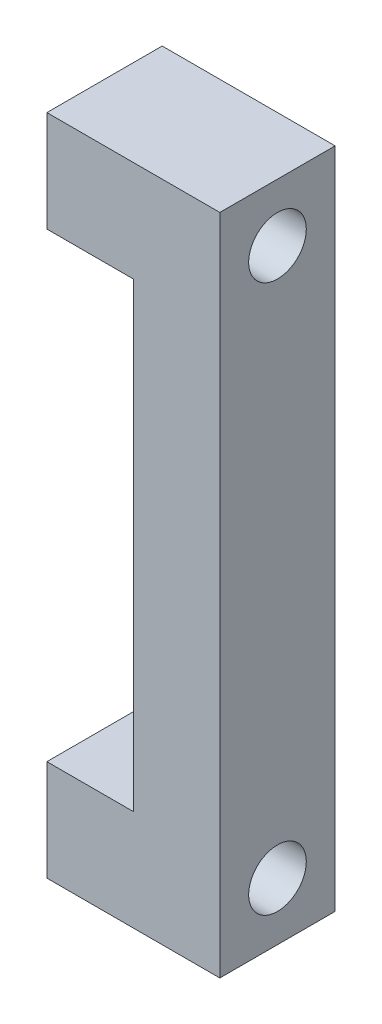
ISO-10303-21;
HEADER;
FILE_DESCRIPTION(('STEP AP214'),'2;1');
FILE_NAME('part.step','',(''),(''),'','','');
FILE_SCHEMA(('AUTOMOTIVE_DESIGN { 1 0 10303 214 1 1 1 1 }'));
ENDSEC;
DATA;
#1=APPLICATION_CONTEXT('core data for automotive mechanical design processes');
#2=APPLICATION_PROTOCOL_DEFINITION('international standard','automotive_design',2000,#1);
#3=PRODUCT_CONTEXT('',#1,'mechanical');
#4=PRODUCT('Part','Part','',(#3));
#5=PRODUCT_RELATED_PRODUCT_CATEGORY('part','',(#4));
#6=PRODUCT_DEFINITION_FORMATION('','',#4);
#7=PRODUCT_DEFINITION_CONTEXT('part definition',#1,'design');
#8=PRODUCT_DEFINITION('design','',#6,#7);
#9=PRODUCT_DEFINITION_SHAPE('','',#8);
#10=(LENGTH_UNIT() NAMED_UNIT(*) SI_UNIT(.MILLI.,.METRE.));
#11=(NAMED_UNIT(*) PLANE_ANGLE_UNIT() SI_UNIT($,.RADIAN.));
#12=(NAMED_UNIT(*) SI_UNIT($,.STERADIAN.) SOLID_ANGLE_UNIT());
#13=UNCERTAINTY_MEASURE_WITH_UNIT(LENGTH_MEASURE(1.E-05),#10,'distance_accuracy_value','');
#14=(GEOMETRIC_REPRESENTATION_CONTEXT(3) GLOBAL_UNCERTAINTY_ASSIGNED_CONTEXT((#13)) GLOBAL_UNIT_ASSIGNED_CONTEXT((#10,
#11,#12)) REPRESENTATION_CONTEXT('',''));
#15=CARTESIAN_POINT('',(0.,0.,0.));
#16=DIRECTION('',(0.,0.,1.));
#17=DIRECTION('',(1.,0.,0.));
#18=AXIS2_PLACEMENT_3D('',#15,#16,#17);
#19=CARTESIAN_POINT('',(-19.05,-25.4,6.35));
#20=DIRECTION('',(1.,0.,0.));
#21=DIRECTION('',(0.,0.,-1.));
#22=AXIS2_PLACEMENT_3D('',#19,#20,#21);
#23=PLANE('',#22);
#24=CARTESIAN_POINT('',(-19.05,-30.1625,0.));
#25=DIRECTION('',(1.,0.,0.));
#26=DIRECTION('',(0.,0.,-1.));
#27=AXIS2_PLACEMENT_3D('',#24,#25,#26);
#28=CIRCLE('',#27,3.175);
#29=CARTESIAN_POINT('',(-19.05,-30.1625,-3.175));
#30=VERTEX_POINT('',#29);
#31=EDGE_CURVE('E183',#30,#30,#28,.T.);
#32=ORIENTED_EDGE('',*,*,#31,.T.);
#33=EDGE_LOOP('',(#32));
#34=FACE_BOUND('',#33,.T.);
#35=DIRECTION('',(0.,-1.,0.));
#36=VECTOR('',#35,1.);
#37=CARTESIAN_POINT('',(-19.05,-25.4,-6.35));
#38=LINE('',#37,#36);
#39=CARTESIAN_POINT('',(-19.05,-25.4,-6.35));
#40=VERTEX_POINT('',#39);
#41=CARTESIAN_POINT('',(-19.05,-36.5125,-6.35));
#42=VERTEX_POINT('',#41);
#43=EDGE_CURVE('E130',#40,#42,#38,.T.);
#44=ORIENTED_EDGE('',*,*,#43,.T.);
#45=DIRECTION('',(0.,0.,-1.));
#46=VECTOR('',#45,1.);
#47=CARTESIAN_POINT('',(-19.05,-36.5125,6.35));
#48=LINE('',#47,#46);
#49=CARTESIAN_POINT('',(-19.05,-36.5125,6.35));
#50=VERTEX_POINT('',#49);
#51=EDGE_CURVE('E11',#50,#42,#48,.T.);
#52=ORIENTED_EDGE('',*,*,#51,.F.);
#53=DIRECTION('',(0.,-1.,0.));
#54=VECTOR('',#53,1.);
#55=CARTESIAN_POINT('',(-19.05,-25.4,6.35));
#56=LINE('',#55,#54);
#57=CARTESIAN_POINT('',(-19.05,-25.4,6.35));
#58=VERTEX_POINT('',#57);
#59=EDGE_CURVE('E145',#58,#50,#56,.T.);
#60=ORIENTED_EDGE('',*,*,#59,.F.);
#61=DIRECTION('',(0.,0.,-1.));
#62=VECTOR('',#61,1.);
#63=CARTESIAN_POINT('',(-19.05,-25.4,6.35));
#64=LINE('',#63,#62);
#65=EDGE_CURVE('E126',#58,#40,#64,.T.);
#66=ORIENTED_EDGE('',*,*,#65,.T.);
#67=EDGE_LOOP('',(#44,#52,#60,#66));
#68=FACE_BOUND('',#67,.T.);
#69=ADVANCED_FACE('F33',(#34,#68),#23,.F.);
#70=CARTESIAN_POINT('',(-19.05,-36.5125,6.35));
#71=DIRECTION('',(0.,1.,0.));
#72=DIRECTION('',(0.,0.,1.));
#73=AXIS2_PLACEMENT_3D('',#70,#71,#72);
#74=PLANE('',#73);
#75=DIRECTION('',(1.,0.,0.));
#76=VECTOR('',#75,1.);
#77=CARTESIAN_POINT('',(-19.05,-36.5125,-6.35));
#78=LINE('',#77,#76);
#79=CARTESIAN_POINT('',(0.,-36.5125,-6.35));
#80=VERTEX_POINT('',#79);
#81=EDGE_CURVE('E133',#42,#80,#78,.T.);
#82=ORIENTED_EDGE('',*,*,#81,.T.);
#83=DIRECTION('',(0.,0.,-1.));
#84=VECTOR('',#83,1.);
#85=CARTESIAN_POINT('',(0.,-36.5125,6.35));
#86=LINE('',#85,#84);
#87=CARTESIAN_POINT('',(0.,-36.5125,6.35));
#88=VERTEX_POINT('',#87);
#89=EDGE_CURVE('E42',#88,#80,#86,.T.);
#90=ORIENTED_EDGE('',*,*,#89,.F.);
#91=DIRECTION('',(1.,0.,0.));
#92=VECTOR('',#91,1.);
#93=CARTESIAN_POINT('',(-19.05,-36.5125,6.35));
#94=LINE('',#93,#92);
#95=EDGE_CURVE('E93',#50,#88,#94,.T.);
#96=ORIENTED_EDGE('',*,*,#95,.F.);
#97=ORIENTED_EDGE('',*,*,#51,.T.);
#98=EDGE_LOOP('',(#82,#90,#96,#97));
#99=FACE_BOUND('',#98,.T.);
#100=ADVANCED_FACE('F161',(#99),#74,.F.);
#101=CARTESIAN_POINT('',(0.,0.,6.35));
#102=DIRECTION('',(-1.,0.,0.));
#103=DIRECTION('',(0.,0.,1.));
#104=AXIS2_PLACEMENT_3D('',#101,#102,#103);
#105=PLANE('',#104);
#106=CARTESIAN_POINT('',(0.,-30.1625,0.));
#107=DIRECTION('',(1.,0.,0.));
#108=DIRECTION('',(0.,0.,-1.));
#109=AXIS2_PLACEMENT_3D('',#106,#107,#108);
#110=CIRCLE('',#109,3.175);
#111=CARTESIAN_POINT('',(0.,-30.1625,-3.175));
#112=VERTEX_POINT('',#111);
#113=EDGE_CURVE('E186',#112,#112,#110,.T.);
#114=ORIENTED_EDGE('',*,*,#113,.F.);
#115=EDGE_LOOP('',(#114));
#116=FACE_BOUND('',#115,.T.);
#117=CARTESIAN_POINT('',(0.,30.1625,0.));
#118=DIRECTION('',(1.,0.,0.));
#119=DIRECTION('',(0.,0.,-1.));
#120=AXIS2_PLACEMENT_3D('',#117,#118,#119);
#121=CIRCLE('',#120,3.175);
#122=CARTESIAN_POINT('',(0.,30.1625,-3.175));
#123=VERTEX_POINT('',#122);
#124=EDGE_CURVE('E180',#123,#123,#121,.T.);
#125=ORIENTED_EDGE('',*,*,#124,.F.);
#126=EDGE_LOOP('',(#125));
#127=FACE_BOUND('',#126,.T.);
#128=DIRECTION('',(0.,1.,0.));
#129=VECTOR('',#128,1.);
#130=CARTESIAN_POINT('',(0.,0.,-6.35));
#131=LINE('',#130,#129);
#132=CARTESIAN_POINT('',(0.,36.5125,-6.35));
#133=VERTEX_POINT('',#132);
#134=EDGE_CURVE('E136',#80,#133,#131,.T.);
#135=ORIENTED_EDGE('',*,*,#134,.T.);
#136=DIRECTION('',(0.,0.,-1.));
#137=VECTOR('',#136,1.);
#138=CARTESIAN_POINT('',(0.,36.5125,6.35));
#139=LINE('',#138,#137);
#140=CARTESIAN_POINT('',(0.,36.5125,6.35));
#141=VERTEX_POINT('',#140);
#142=EDGE_CURVE('E152',#141,#133,#139,.T.);
#143=ORIENTED_EDGE('',*,*,#142,.F.);
#144=DIRECTION('',(0.,1.,0.));
#145=VECTOR('',#144,1.);
#146=CARTESIAN_POINT('',(0.,-36.5125,6.35));
#147=LINE('',#146,#145);
#148=EDGE_CURVE('E160',#88,#141,#147,.T.);
#149=ORIENTED_EDGE('',*,*,#148,.F.);
#150=ORIENTED_EDGE('',*,*,#89,.T.);
#151=EDGE_LOOP('',(#135,#143,#149,#150));
#152=FACE_BOUND('',#151,.T.);
#153=ADVANCED_FACE('F158',(#116,#127,#152),#105,.F.);
#154=CARTESIAN_POINT('',(0.,36.5125,6.35));
#155=DIRECTION('',(0.,-1.,0.));
#156=DIRECTION('',(0.,0.,-1.));
#157=AXIS2_PLACEMENT_3D('',#154,#155,#156);
#158=PLANE('',#157);
#159=DIRECTION('',(-1.,0.,0.));
#160=VECTOR('',#159,1.);
#161=CARTESIAN_POINT('',(0.,36.5125,-6.35));
#162=LINE('',#161,#160);
#163=CARTESIAN_POINT('',(-19.05,36.5125,-6.35));
#164=VERTEX_POINT('',#163);
#165=EDGE_CURVE('E138',#133,#164,#162,.T.);
#166=ORIENTED_EDGE('',*,*,#165,.T.);
#167=DIRECTION('',(0.,0.,-1.));
#168=VECTOR('',#167,1.);
#169=CARTESIAN_POINT('',(-19.05,36.5125,6.35));
#170=LINE('',#169,#168);
#171=CARTESIAN_POINT('',(-19.05,36.5125,6.35));
#172=VERTEX_POINT('',#171);
#173=EDGE_CURVE('E149',#172,#164,#170,.T.);
#174=ORIENTED_EDGE('',*,*,#173,.F.);
#175=DIRECTION('',(-1.,0.,0.));
#176=VECTOR('',#175,1.);
#177=CARTESIAN_POINT('',(0.,36.5125,6.35));
#178=LINE('',#177,#176);
#179=EDGE_CURVE('E174',#141,#172,#178,.T.);
#180=ORIENTED_EDGE('',*,*,#179,.F.);
#181=ORIENTED_EDGE('',*,*,#142,.T.);
#182=EDGE_LOOP('',(#166,#174,#180,#181));
#183=FACE_BOUND('',#182,.T.);
#184=ADVANCED_FACE('F170',(#183),#158,.F.);
#185=CARTESIAN_POINT('',(-19.05,36.5125,6.35));
#186=DIRECTION('',(1.,0.,0.));
#187=DIRECTION('',(0.,1.,0.));
#188=AXIS2_PLACEMENT_3D('',#185,#186,#187);
#189=PLANE('',#188);
#190=CARTESIAN_POINT('',(-19.05,30.1625,0.));
#191=DIRECTION('',(1.,0.,0.));
#192=DIRECTION('',(0.,1.,0.));
#193=AXIS2_PLACEMENT_3D('',#190,#191,#192);
#194=CIRCLE('',#193,3.175);
#195=CARTESIAN_POINT('',(-19.05,33.3375,0.));
#196=VERTEX_POINT('',#195);
#197=EDGE_CURVE('E36',#196,#196,#194,.T.);
#198=ORIENTED_EDGE('',*,*,#197,.T.);
#199=EDGE_LOOP('',(#198));
#200=FACE_BOUND('',#199,.T.);
#201=DIRECTION('',(0.,-1.,0.));
#202=VECTOR('',#201,1.);
#203=CARTESIAN_POINT('',(-19.05,36.5125,-6.35));
#204=LINE('',#203,#202);
#205=CARTESIAN_POINT('',(-19.05,25.4,-6.35));
#206=VERTEX_POINT('',#205);
#207=EDGE_CURVE('E140',#164,#206,#204,.T.);
#208=ORIENTED_EDGE('',*,*,#207,.T.);
#209=DIRECTION('',(0.,0.,-1.));
#210=VECTOR('',#209,1.);
#211=CARTESIAN_POINT('',(-19.05,25.4,6.35));
#212=LINE('',#211,#210);
#213=CARTESIAN_POINT('',(-19.05,25.4,6.35));
#214=VERTEX_POINT('',#213);
#215=EDGE_CURVE('E121',#214,#206,#212,.T.);
#216=ORIENTED_EDGE('',*,*,#215,.F.);
#217=DIRECTION('',(0.,-1.,0.));
#218=VECTOR('',#217,1.);
#219=CARTESIAN_POINT('',(-19.05,36.5125,6.35));
#220=LINE('',#219,#218);
#221=EDGE_CURVE('E112',#172,#214,#220,.T.);
#222=ORIENTED_EDGE('',*,*,#221,.F.);
#223=ORIENTED_EDGE('',*,*,#173,.T.);
#224=EDGE_LOOP('',(#208,#216,#222,#223));
#225=FACE_BOUND('',#224,.T.);
#226=ADVANCED_FACE('F173',(#200,#225),#189,.F.);
#227=CARTESIAN_POINT('',(-19.05,25.4,6.35));
#228=DIRECTION('',(0.,1.,0.));
#229=DIRECTION('',(0.,0.,1.));
#230=AXIS2_PLACEMENT_3D('',#227,#228,#229);
#231=PLANE('',#230);
#232=DIRECTION('',(1.,0.,0.));
#233=VECTOR('',#232,1.);
#234=CARTESIAN_POINT('',(-19.05,25.4,-6.35));
#235=LINE('',#234,#233);
#236=CARTESIAN_POINT('',(-9.525,25.4,-6.35));
#237=VERTEX_POINT('',#236);
#238=EDGE_CURVE('E120',#206,#237,#235,.T.);
#239=ORIENTED_EDGE('',*,*,#238,.T.);
#240=DIRECTION('',(0.,0.,-1.));
#241=VECTOR('',#240,1.);
#242=CARTESIAN_POINT('',(-9.525,25.4,6.35));
#243=LINE('',#242,#241);
#244=CARTESIAN_POINT('',(-9.525,25.4,6.35));
#245=VERTEX_POINT('',#244);
#246=EDGE_CURVE('E117',#245,#237,#243,.T.);
#247=ORIENTED_EDGE('',*,*,#246,.F.);
#248=DIRECTION('',(1.,0.,0.));
#249=VECTOR('',#248,1.);
#250=CARTESIAN_POINT('',(-19.05,25.4,6.35));
#251=LINE('',#250,#249);
#252=EDGE_CURVE('E106',#214,#245,#251,.T.);
#253=ORIENTED_EDGE('',*,*,#252,.F.);
#254=ORIENTED_EDGE('',*,*,#215,.T.);
#255=EDGE_LOOP('',(#239,#247,#253,#254));
#256=FACE_BOUND('',#255,.T.);
#257=ADVANCED_FACE('F118',(#256),#231,.F.);
#258=CARTESIAN_POINT('',(-9.525,25.4,6.35));
#259=DIRECTION('',(1.,0.,0.));
#260=DIRECTION('',(0.,0.,-1.));
#261=AXIS2_PLACEMENT_3D('',#258,#259,#260);
#262=PLANE('',#261);
#263=DIRECTION('',(0.,-1.,0.));
#264=VECTOR('',#263,1.);
#265=CARTESIAN_POINT('',(-9.525,25.4,-6.35));
#266=LINE('',#265,#264);
#267=CARTESIAN_POINT('',(-9.525,-25.4,-6.35));
#268=VERTEX_POINT('',#267);
#269=EDGE_CURVE('E79',#237,#268,#266,.T.);
#270=ORIENTED_EDGE('',*,*,#269,.T.);
#271=DIRECTION('',(0.,0.,-1.));
#272=VECTOR('',#271,1.);
#273=CARTESIAN_POINT('',(-9.525,-25.4,6.35));
#274=LINE('',#273,#272);
#275=CARTESIAN_POINT('',(-9.525,-25.4,6.35));
#276=VERTEX_POINT('',#275);
#277=EDGE_CURVE('E122',#276,#268,#274,.T.);
#278=ORIENTED_EDGE('',*,*,#277,.F.);
#279=DIRECTION('',(0.,-1.,0.));
#280=VECTOR('',#279,1.);
#281=CARTESIAN_POINT('',(-9.525,25.4,6.35));
#282=LINE('',#281,#280);
#283=EDGE_CURVE('E110',#245,#276,#282,.T.);
#284=ORIENTED_EDGE('',*,*,#283,.F.);
#285=ORIENTED_EDGE('',*,*,#246,.T.);
#286=EDGE_LOOP('',(#270,#278,#284,#285));
#287=FACE_BOUND('',#286,.T.);
#288=ADVANCED_FACE('F124',(#287),#262,.F.);
#289=CARTESIAN_POINT('',(-9.525,-25.4,6.35));
#290=DIRECTION('',(0.,-1.,0.));
#291=DIRECTION('',(0.,0.,-1.));
#292=AXIS2_PLACEMENT_3D('',#289,#290,#291);
#293=PLANE('',#292);
#294=DIRECTION('',(-1.,0.,0.));
#295=VECTOR('',#294,1.);
#296=CARTESIAN_POINT('',(-9.525,-25.4,-6.35));
#297=LINE('',#296,#295);
#298=EDGE_CURVE('E85',#268,#40,#297,.T.);
#299=ORIENTED_EDGE('',*,*,#298,.T.);
#300=ORIENTED_EDGE('',*,*,#65,.F.);
#301=DIRECTION('',(-1.,0.,0.));
#302=VECTOR('',#301,1.);
#303=CARTESIAN_POINT('',(-9.525,-25.4,6.35));
#304=LINE('',#303,#302);
#305=EDGE_CURVE('E50',#276,#58,#304,.T.);
#306=ORIENTED_EDGE('',*,*,#305,.F.);
#307=ORIENTED_EDGE('',*,*,#277,.T.);
#308=EDGE_LOOP('',(#299,#300,#306,#307));
#309=FACE_BOUND('',#308,.T.);
#310=ADVANCED_FACE('F221',(#309),#293,.F.);
#311=CARTESIAN_POINT('',(0.,0.,6.35));
#312=DIRECTION('',(0.,0.,1.));
#313=DIRECTION('',(1.,0.,0.));
#314=AXIS2_PLACEMENT_3D('',#311,#312,#313);
#315=PLANE('',#314);
#316=ORIENTED_EDGE('',*,*,#59,.T.);
#317=ORIENTED_EDGE('',*,*,#95,.T.);
#318=ORIENTED_EDGE('',*,*,#148,.T.);
#319=ORIENTED_EDGE('',*,*,#179,.T.);
#320=ORIENTED_EDGE('',*,*,#221,.T.);
#321=ORIENTED_EDGE('',*,*,#252,.T.);
#322=ORIENTED_EDGE('',*,*,#283,.T.);
#323=ORIENTED_EDGE('',*,*,#305,.T.);
#324=EDGE_LOOP('',(#316,#317,#318,#319,#320,#321,#322,#323));
#325=FACE_BOUND('',#324,.T.);
#326=ADVANCED_FACE('F108',(#325),#315,.T.);
#327=CARTESIAN_POINT('',(0.,0.,-6.35));
#328=DIRECTION('',(0.,0.,1.));
#329=DIRECTION('',(1.,0.,0.));
#330=AXIS2_PLACEMENT_3D('',#327,#328,#329);
#331=PLANE('',#330);
#332=ORIENTED_EDGE('',*,*,#43,.F.);
#333=ORIENTED_EDGE('',*,*,#298,.F.);
#334=ORIENTED_EDGE('',*,*,#269,.F.);
#335=ORIENTED_EDGE('',*,*,#238,.F.);
#336=ORIENTED_EDGE('',*,*,#207,.F.);
#337=ORIENTED_EDGE('',*,*,#165,.F.);
#338=ORIENTED_EDGE('',*,*,#134,.F.);
#339=ORIENTED_EDGE('',*,*,#81,.F.);
#340=EDGE_LOOP('',(#332,#333,#334,#335,#336,#337,#338,#339));
#341=FACE_BOUND('',#340,.T.);
#342=ADVANCED_FACE('F165',(#341),#331,.F.);
#343=CARTESIAN_POINT('',(-25.4,30.1625,0.));
#344=DIRECTION('',(1.,0.,0.));
#345=DIRECTION('',(0.,0.,-1.));
#346=AXIS2_PLACEMENT_3D('',#343,#344,#345);
#347=CYLINDRICAL_SURFACE('',#346,3.175);
#348=ORIENTED_EDGE('',*,*,#124,.T.);
#349=EDGE_LOOP('',(#348));
#350=FACE_BOUND('',#349,.T.);
#351=ORIENTED_EDGE('',*,*,#197,.F.);
#352=EDGE_LOOP('',(#351));
#353=FACE_BOUND('',#352,.T.);
#354=ADVANCED_FACE('F198',(#350,#353),#347,.F.);
#355=CARTESIAN_POINT('',(-25.4,-30.1625,0.));
#356=DIRECTION('',(1.,0.,0.));
#357=DIRECTION('',(0.,0.,-1.));
#358=AXIS2_PLACEMENT_3D('',#355,#356,#357);
#359=CYLINDRICAL_SURFACE('',#358,3.175);
#360=ORIENTED_EDGE('',*,*,#113,.T.);
#361=EDGE_LOOP('',(#360));
#362=FACE_BOUND('',#361,.T.);
#363=ORIENTED_EDGE('',*,*,#31,.F.);
#364=EDGE_LOOP('',(#363));
#365=FACE_BOUND('',#364,.T.);
#366=ADVANCED_FACE('F190',(#362,#365),#359,.F.);
#367=CLOSED_SHELL('',(#69,#100,#153,#184,#226,#257,#288,#310,#326,#342,#354,#366));
#368=MANIFOLD_SOLID_BREP('B2',#367);
#369=ADVANCED_BREP_SHAPE_REPRESENTATION('',(#18,#368),#14);
#370=SHAPE_DEFINITION_REPRESENTATION(#9,#369);
ENDSEC;
END-ISO-10303-21;
